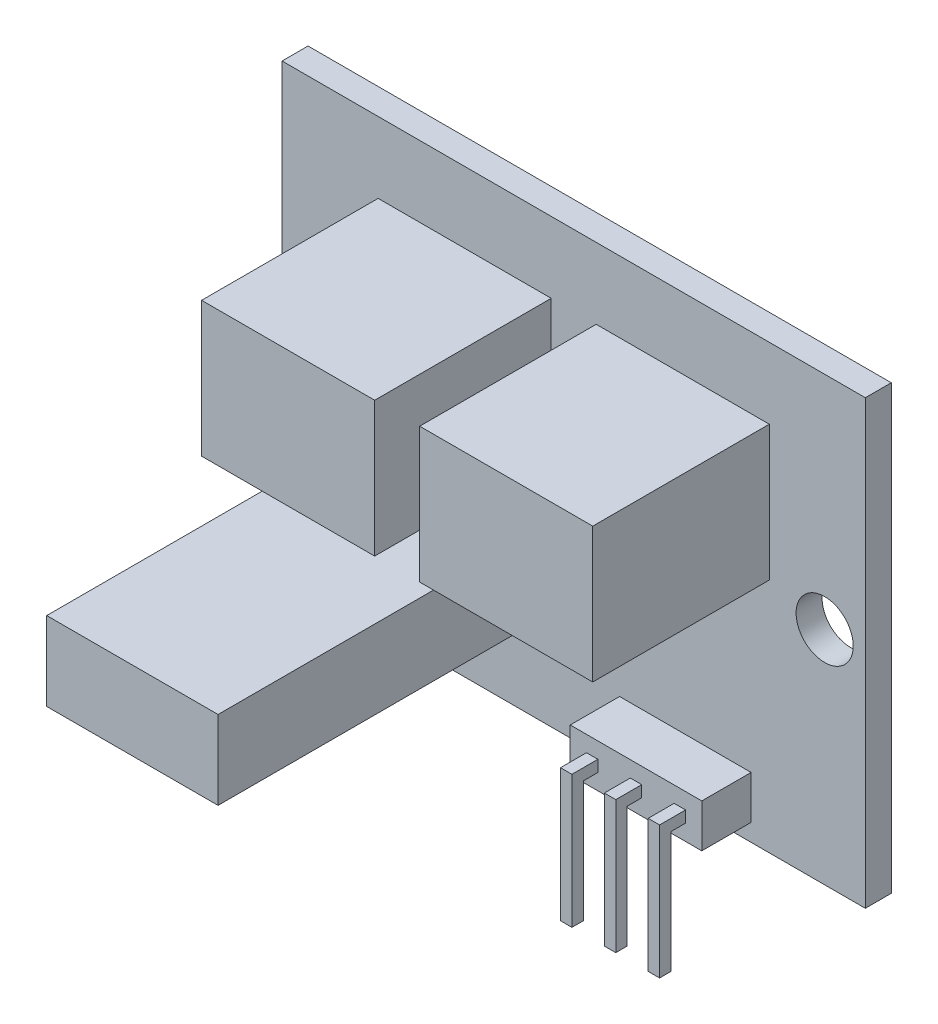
ISO-10303-21;
HEADER;
FILE_DESCRIPTION(('STEP AP214'),'2;1');
FILE_NAME('part.step','',(''),(''),'','','');
FILE_SCHEMA(('AUTOMOTIVE_DESIGN { 1 0 10303 214 1 1 1 1 }'));
ENDSEC;
DATA;
#1=APPLICATION_CONTEXT('core data for automotive mechanical design processes');
#2=APPLICATION_PROTOCOL_DEFINITION('international standard','automotive_design',2000,#1);
#3=PRODUCT_CONTEXT('',#1,'mechanical');
#4=PRODUCT('Part','Part','',(#3));
#5=PRODUCT_RELATED_PRODUCT_CATEGORY('part','',(#4));
#6=PRODUCT_DEFINITION_FORMATION('','',#4);
#7=PRODUCT_DEFINITION_CONTEXT('part definition',#1,'design');
#8=PRODUCT_DEFINITION('design','',#6,#7);
#9=PRODUCT_DEFINITION_SHAPE('','',#8);
#10=(LENGTH_UNIT() NAMED_UNIT(*) SI_UNIT(.MILLI.,.METRE.));
#11=(NAMED_UNIT(*) PLANE_ANGLE_UNIT() SI_UNIT($,.RADIAN.));
#12=(NAMED_UNIT(*) SI_UNIT($,.STERADIAN.) SOLID_ANGLE_UNIT());
#13=UNCERTAINTY_MEASURE_WITH_UNIT(LENGTH_MEASURE(1.E-05),#10,'distance_accuracy_value','');
#14=(GEOMETRIC_REPRESENTATION_CONTEXT(3) GLOBAL_UNCERTAINTY_ASSIGNED_CONTEXT((#13)) GLOBAL_UNIT_ASSIGNED_CONTEXT((#10,
#11,#12)) REPRESENTATION_CONTEXT('',''));
#15=CARTESIAN_POINT('',(0.,0.,0.));
#16=DIRECTION('',(0.,0.,1.));
#17=DIRECTION('',(1.,0.,0.));
#18=AXIS2_PLACEMENT_3D('',#15,#16,#17);
#19=CARTESIAN_POINT('',(25.5033333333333,1.92,5.85));
#20=DIRECTION('',(0.,1.,0.));
#21=DIRECTION('',(0.,0.,1.));
#22=AXIS2_PLACEMENT_3D('',#19,#20,#21);
#23=PLANE('',#22);
#24=DIRECTION('',(1.,0.,0.));
#25=VECTOR('',#24,1.);
#26=CARTESIAN_POINT('',(25.5033333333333,1.92,5.19));
#27=LINE('',#26,#25);
#28=CARTESIAN_POINT('',(25.5033333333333,1.92,5.19));
#29=VERTEX_POINT('',#28);
#30=CARTESIAN_POINT('',(26.1633333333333,1.92,5.19));
#31=VERTEX_POINT('',#30);
#32=EDGE_CURVE('E388',#29,#31,#27,.T.);
#33=ORIENTED_EDGE('',*,*,#32,.F.);
#34=DIRECTION('',(0.,0.,-1.));
#35=VECTOR('',#34,1.);
#36=CARTESIAN_POINT('',(25.5033333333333,1.92,5.85));
#37=LINE('',#36,#35);
#38=CARTESIAN_POINT('',(25.5033333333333,1.92,4.35));
#39=VERTEX_POINT('',#38);
#40=EDGE_CURVE('E393',#29,#39,#37,.T.);
#41=ORIENTED_EDGE('',*,*,#40,.T.);
#42=DIRECTION('',(1.,0.,0.));
#43=VECTOR('',#42,1.);
#44=CARTESIAN_POINT('',(25.5033333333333,1.92,4.35));
#45=LINE('',#44,#43);
#46=CARTESIAN_POINT('',(26.1633333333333,1.92,4.35));
#47=VERTEX_POINT('',#46);
#48=EDGE_CURVE('E465',#39,#47,#45,.T.);
#49=ORIENTED_EDGE('',*,*,#48,.T.);
#50=DIRECTION('',(0.,0.,-1.));
#51=VECTOR('',#50,1.);
#52=CARTESIAN_POINT('',(26.1633333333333,1.92,5.85));
#53=LINE('',#52,#51);
#54=EDGE_CURVE('E478',#31,#47,#53,.T.);
#55=ORIENTED_EDGE('',*,*,#54,.F.);
#56=EDGE_LOOP('',(#33,#41,#49,#55));
#57=FACE_BOUND('',#56,.T.);
#58=ADVANCED_FACE('F42',(#57),#23,.F.);
#59=CARTESIAN_POINT('',(23.63,1.92,5.85));
#60=DIRECTION('',(0.,1.,0.));
#61=DIRECTION('',(0.,0.,1.));
#62=AXIS2_PLACEMENT_3D('',#59,#60,#61);
#63=PLANE('',#62);
#64=DIRECTION('',(1.,0.,0.));
#65=VECTOR('',#64,1.);
#66=CARTESIAN_POINT('',(22.97,1.92,5.19));
#67=LINE('',#66,#65);
#68=CARTESIAN_POINT('',(22.97,1.92,5.19));
#69=VERTEX_POINT('',#68);
#70=CARTESIAN_POINT('',(23.63,1.92,5.19));
#71=VERTEX_POINT('',#70);
#72=EDGE_CURVE('E395',#69,#71,#67,.T.);
#73=ORIENTED_EDGE('',*,*,#72,.F.);
#74=DIRECTION('',(0.,0.,-1.));
#75=VECTOR('',#74,1.);
#76=CARTESIAN_POINT('',(22.97,1.92,5.85));
#77=LINE('',#76,#75);
#78=CARTESIAN_POINT('',(22.97,1.92,4.35));
#79=VERTEX_POINT('',#78);
#80=EDGE_CURVE('E513',#69,#79,#77,.T.);
#81=ORIENTED_EDGE('',*,*,#80,.T.);
#82=DIRECTION('',(1.,0.,0.));
#83=VECTOR('',#82,1.);
#84=CARTESIAN_POINT('',(23.63,1.92,4.35));
#85=LINE('',#84,#83);
#86=CARTESIAN_POINT('',(23.63,1.92,4.35));
#87=VERTEX_POINT('',#86);
#88=EDGE_CURVE('E503',#79,#87,#85,.T.);
#89=ORIENTED_EDGE('',*,*,#88,.T.);
#90=DIRECTION('',(0.,0.,-1.));
#91=VECTOR('',#90,1.);
#92=CARTESIAN_POINT('',(23.63,1.92,5.85));
#93=LINE('',#92,#91);
#94=EDGE_CURVE('E72',#71,#87,#93,.T.);
#95=ORIENTED_EDGE('',*,*,#94,.F.);
#96=EDGE_LOOP('',(#73,#81,#89,#95));
#97=FACE_BOUND('',#96,.T.);
#98=ADVANCED_FACE('F816',(#97),#63,.F.);
#99=CARTESIAN_POINT('',(20.4366666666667,1.92,5.85));
#100=DIRECTION('',(0.,1.,0.));
#101=DIRECTION('',(0.,0.,1.));
#102=AXIS2_PLACEMENT_3D('',#99,#100,#101);
#103=PLANE('',#102);
#104=DIRECTION('',(1.,0.,0.));
#105=VECTOR('',#104,1.);
#106=CARTESIAN_POINT('',(20.4366666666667,1.92,5.19));
#107=LINE('',#106,#105);
#108=CARTESIAN_POINT('',(20.4366666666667,1.92,5.19));
#109=VERTEX_POINT('',#108);
#110=CARTESIAN_POINT('',(21.0966666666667,1.92,5.19));
#111=VERTEX_POINT('',#110);
#112=EDGE_CURVE('E426',#109,#111,#107,.T.);
#113=ORIENTED_EDGE('',*,*,#112,.F.);
#114=DIRECTION('',(0.,0.,-1.));
#115=VECTOR('',#114,1.);
#116=CARTESIAN_POINT('',(20.4366666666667,1.92,5.85));
#117=LINE('',#116,#115);
#118=CARTESIAN_POINT('',(20.4366666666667,1.92,4.35));
#119=VERTEX_POINT('',#118);
#120=EDGE_CURVE('E553',#109,#119,#117,.T.);
#121=ORIENTED_EDGE('',*,*,#120,.T.);
#122=DIRECTION('',(1.,0.,0.));
#123=VECTOR('',#122,1.);
#124=CARTESIAN_POINT('',(20.4366666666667,1.92,4.35));
#125=LINE('',#124,#123);
#126=CARTESIAN_POINT('',(21.0966666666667,1.92,4.35));
#127=VERTEX_POINT('',#126);
#128=EDGE_CURVE('E534',#119,#127,#125,.T.);
#129=ORIENTED_EDGE('',*,*,#128,.T.);
#130=DIRECTION('',(0.,0.,-1.));
#131=VECTOR('',#130,1.);
#132=CARTESIAN_POINT('',(21.0966666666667,1.92,5.85));
#133=LINE('',#132,#131);
#134=EDGE_CURVE('E550',#111,#127,#133,.T.);
#135=ORIENTED_EDGE('',*,*,#134,.F.);
#136=EDGE_LOOP('',(#113,#121,#129,#135));
#137=FACE_BOUND('',#136,.T.);
#138=ADVANCED_FACE('F822',(#137),#103,.F.);
#139=CARTESIAN_POINT('',(0.,0.,4.35));
#140=DIRECTION('',(0.,0.,1.));
#141=DIRECTION('',(1.,0.,0.));
#142=AXIS2_PLACEMENT_3D('',#139,#140,#141);
#143=PLANE('',#142);
#144=DIRECTION('',(0.,-1.,0.));
#145=VECTOR('',#144,1.);
#146=CARTESIAN_POINT('',(19.5,3.5,4.35));
#147=LINE('',#146,#145);
#148=CARTESIAN_POINT('',(19.5,3.5,4.35));
#149=VERTEX_POINT('',#148);
#150=CARTESIAN_POINT('',(19.5,1.,4.35));
#151=VERTEX_POINT('',#150);
#152=EDGE_CURVE('E557',#149,#151,#147,.T.);
#153=ORIENTED_EDGE('',*,*,#152,.T.);
#154=DIRECTION('',(1.,0.,0.));
#155=VECTOR('',#154,1.);
#156=CARTESIAN_POINT('',(19.5,1.,4.35));
#157=LINE('',#156,#155);
#158=CARTESIAN_POINT('',(27.1,1.,4.35));
#159=VERTEX_POINT('',#158);
#160=EDGE_CURVE('E561',#151,#159,#157,.T.);
#161=ORIENTED_EDGE('',*,*,#160,.T.);
#162=DIRECTION('',(0.,1.,0.));
#163=VECTOR('',#162,1.);
#164=CARTESIAN_POINT('',(27.1,3.5,4.35));
#165=LINE('',#164,#163);
#166=CARTESIAN_POINT('',(27.1,3.5,4.35));
#167=VERTEX_POINT('',#166);
#168=EDGE_CURVE('E565',#159,#167,#165,.T.);
#169=ORIENTED_EDGE('',*,*,#168,.T.);
#170=DIRECTION('',(-1.,0.,0.));
#171=VECTOR('',#170,1.);
#172=CARTESIAN_POINT('',(19.5,3.5,4.35));
#173=LINE('',#172,#171);
#174=EDGE_CURVE('E568',#167,#149,#173,.T.);
#175=ORIENTED_EDGE('',*,*,#174,.T.);
#176=EDGE_LOOP('',(#153,#161,#169,#175));
#177=FACE_BOUND('',#176,.T.);
#178=ORIENTED_EDGE('',*,*,#128,.F.);
#179=DIRECTION('',(0.,-1.,0.));
#180=VECTOR('',#179,1.);
#181=CARTESIAN_POINT('',(20.4366666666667,2.58,4.35));
#182=LINE('',#181,#180);
#183=CARTESIAN_POINT('',(20.4366666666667,2.58,4.35));
#184=VERTEX_POINT('',#183);
#185=EDGE_CURVE('E519',#184,#119,#182,.T.);
#186=ORIENTED_EDGE('',*,*,#185,.F.);
#187=DIRECTION('',(-1.,0.,0.));
#188=VECTOR('',#187,1.);
#189=CARTESIAN_POINT('',(20.4366666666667,2.58,4.35));
#190=LINE('',#189,#188);
#191=CARTESIAN_POINT('',(21.0966666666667,2.58,4.35));
#192=VERTEX_POINT('',#191);
#193=EDGE_CURVE('E524',#192,#184,#190,.T.);
#194=ORIENTED_EDGE('',*,*,#193,.F.);
#195=DIRECTION('',(0.,1.,0.));
#196=VECTOR('',#195,1.);
#197=CARTESIAN_POINT('',(21.0966666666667,2.58,4.35));
#198=LINE('',#197,#196);
#199=EDGE_CURVE('E538',#127,#192,#198,.T.);
#200=ORIENTED_EDGE('',*,*,#199,.F.);
#201=EDGE_LOOP('',(#178,#186,#194,#200));
#202=FACE_BOUND('',#201,.T.);
#203=DIRECTION('',(0.,-1.,0.));
#204=VECTOR('',#203,1.);
#205=CARTESIAN_POINT('',(22.97,2.58,4.35));
#206=LINE('',#205,#204);
#207=CARTESIAN_POINT('',(22.97,2.58,4.35));
#208=VERTEX_POINT('',#207);
#209=EDGE_CURVE('E499',#208,#79,#206,.T.);
#210=ORIENTED_EDGE('',*,*,#209,.F.);
#211=DIRECTION('',(-1.,0.,0.));
#212=VECTOR('',#211,1.);
#213=CARTESIAN_POINT('',(23.63,2.58,4.35));
#214=LINE('',#213,#212);
#215=CARTESIAN_POINT('',(23.63,2.58,4.35));
#216=VERTEX_POINT('',#215);
#217=EDGE_CURVE('E483',#216,#208,#214,.T.);
#218=ORIENTED_EDGE('',*,*,#217,.F.);
#219=DIRECTION('',(0.,1.,0.));
#220=VECTOR('',#219,1.);
#221=CARTESIAN_POINT('',(23.63,2.58,4.35));
#222=LINE('',#221,#220);
#223=EDGE_CURVE('E489',#87,#216,#222,.T.);
#224=ORIENTED_EDGE('',*,*,#223,.F.);
#225=ORIENTED_EDGE('',*,*,#88,.F.);
#226=EDGE_LOOP('',(#210,#218,#224,#225));
#227=FACE_BOUND('',#226,.T.);
#228=ORIENTED_EDGE('',*,*,#48,.F.);
#229=DIRECTION('',(0.,-1.,0.));
#230=VECTOR('',#229,1.);
#231=CARTESIAN_POINT('',(25.5033333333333,2.58,4.35));
#232=LINE('',#231,#230);
#233=CARTESIAN_POINT('',(25.5033333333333,2.58,4.35));
#234=VERTEX_POINT('',#233);
#235=EDGE_CURVE('E451',#234,#39,#232,.T.);
#236=ORIENTED_EDGE('',*,*,#235,.F.);
#237=DIRECTION('',(-1.,0.,0.));
#238=VECTOR('',#237,1.);
#239=CARTESIAN_POINT('',(25.5033333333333,2.58,4.35));
#240=LINE('',#239,#238);
#241=CARTESIAN_POINT('',(26.1633333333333,2.58,4.35));
#242=VERTEX_POINT('',#241);
#243=EDGE_CURVE('E456',#242,#234,#240,.T.);
#244=ORIENTED_EDGE('',*,*,#243,.F.);
#245=DIRECTION('',(0.,1.,0.));
#246=VECTOR('',#245,1.);
#247=CARTESIAN_POINT('',(26.1633333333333,2.58,4.35));
#248=LINE('',#247,#246);
#249=EDGE_CURVE('E469',#47,#242,#248,.T.);
#250=ORIENTED_EDGE('',*,*,#249,.F.);
#251=EDGE_LOOP('',(#228,#236,#244,#250));
#252=FACE_BOUND('',#251,.T.);
#253=ADVANCED_FACE('F861',(#177,#202,#227,#252),#143,.T.);
#254=CARTESIAN_POINT('',(0.,0.,1.5));
#255=DIRECTION('',(0.,0.,-1.));
#256=DIRECTION('',(-1.,0.,0.));
#257=AXIS2_PLACEMENT_3D('',#254,#255,#256);
#258=PLANE('',#257);
#259=DIRECTION('',(0.,-1.,0.));
#260=VECTOR('',#259,1.);
#261=CARTESIAN_POINT('',(5.4,10.,1.5));
#262=LINE('',#261,#260);
#263=CARTESIAN_POINT('',(5.4,10.,1.5));
#264=VERTEX_POINT('',#263);
#265=CARTESIAN_POINT('',(5.4,5.45,1.5));
#266=VERTEX_POINT('',#265);
#267=EDGE_CURVE('E600',#264,#266,#262,.T.);
#268=ORIENTED_EDGE('',*,*,#267,.F.);
#269=DIRECTION('',(-1.,0.,0.));
#270=VECTOR('',#269,1.);
#271=CARTESIAN_POINT('',(5.4,10.,1.5));
#272=LINE('',#271,#270);
#273=CARTESIAN_POINT('',(15.3,10.,1.5));
#274=VERTEX_POINT('',#273);
#275=EDGE_CURVE('E606',#274,#264,#272,.T.);
#276=ORIENTED_EDGE('',*,*,#275,.F.);
#277=DIRECTION('',(0.,1.,0.));
#278=VECTOR('',#277,1.);
#279=CARTESIAN_POINT('',(15.3,10.,1.5));
#280=LINE('',#279,#278);
#281=CARTESIAN_POINT('',(15.3,5.45,1.5));
#282=VERTEX_POINT('',#281);
#283=EDGE_CURVE('E623',#282,#274,#280,.T.);
#284=ORIENTED_EDGE('',*,*,#283,.F.);
#285=DIRECTION('',(1.,0.,0.));
#286=VECTOR('',#285,1.);
#287=CARTESIAN_POINT('',(5.4,5.45,1.5));
#288=LINE('',#287,#286);
#289=EDGE_CURVE('E619',#266,#282,#288,.T.);
#290=ORIENTED_EDGE('',*,*,#289,.F.);
#291=EDGE_LOOP('',(#268,#276,#284,#290));
#292=FACE_BOUND('',#291,.T.);
#293=DIRECTION('',(0.,-1.,0.));
#294=VECTOR('',#293,1.);
#295=CARTESIAN_POINT('',(5.55,21.45,1.5));
#296=LINE('',#295,#294);
#297=CARTESIAN_POINT('',(5.55,21.45,1.5));
#298=VERTEX_POINT('',#297);
#299=CARTESIAN_POINT('',(5.55,13.65,1.5));
#300=VERTEX_POINT('',#299);
#301=EDGE_CURVE('E690',#298,#300,#296,.T.);
#302=ORIENTED_EDGE('',*,*,#301,.F.);
#303=DIRECTION('',(-1.,0.,0.));
#304=VECTOR('',#303,1.);
#305=CARTESIAN_POINT('',(5.55,21.45,1.5));
#306=LINE('',#305,#304);
#307=CARTESIAN_POINT('',(15.55,21.45,1.5));
#308=VERTEX_POINT('',#307);
#309=EDGE_CURVE('E696',#308,#298,#306,.T.);
#310=ORIENTED_EDGE('',*,*,#309,.F.);
#311=DIRECTION('',(0.,1.,0.));
#312=VECTOR('',#311,1.);
#313=CARTESIAN_POINT('',(15.55,21.45,1.5));
#314=LINE('',#313,#312);
#315=CARTESIAN_POINT('',(15.55,13.65,1.5));
#316=VERTEX_POINT('',#315);
#317=EDGE_CURVE('E713',#316,#308,#314,.T.);
#318=ORIENTED_EDGE('',*,*,#317,.F.);
#319=DIRECTION('',(1.,0.,0.));
#320=VECTOR('',#319,1.);
#321=CARTESIAN_POINT('',(5.55,13.65,1.5));
#322=LINE('',#321,#320);
#323=EDGE_CURVE('E709',#300,#316,#322,.T.);
#324=ORIENTED_EDGE('',*,*,#323,.F.);
#325=EDGE_LOOP('',(#302,#310,#318,#324));
#326=FACE_BOUND('',#325,.T.);
#327=DIRECTION('',(0.,-1.,0.));
#328=VECTOR('',#327,1.);
#329=CARTESIAN_POINT('',(0.,0.,1.5));
#330=LINE('',#329,#328);
#331=CARTESIAN_POINT('',(0.,25.55,1.5));
#332=VERTEX_POINT('',#331);
#333=CARTESIAN_POINT('',(0.,0.,1.5));
#334=VERTEX_POINT('',#333);
#335=EDGE_CURVE('E752',#332,#334,#330,.T.);
#336=ORIENTED_EDGE('',*,*,#335,.T.);
#337=DIRECTION('',(1.,0.,0.));
#338=VECTOR('',#337,1.);
#339=CARTESIAN_POINT('',(0.,0.,1.5));
#340=LINE('',#339,#338);
#341=CARTESIAN_POINT('',(33.7,0.,1.5));
#342=VERTEX_POINT('',#341);
#343=EDGE_CURVE('E756',#334,#342,#340,.T.);
#344=ORIENTED_EDGE('',*,*,#343,.T.);
#345=DIRECTION('',(0.,1.,0.));
#346=VECTOR('',#345,1.);
#347=CARTESIAN_POINT('',(33.7,0.,1.5));
#348=LINE('',#347,#346);
#349=CARTESIAN_POINT('',(33.7,25.55,1.5));
#350=VERTEX_POINT('',#349);
#351=EDGE_CURVE('E760',#342,#350,#348,.T.);
#352=ORIENTED_EDGE('',*,*,#351,.T.);
#353=DIRECTION('',(-1.,0.,0.));
#354=VECTOR('',#353,1.);
#355=CARTESIAN_POINT('',(0.,25.55,1.5));
#356=LINE('',#355,#354);
#357=EDGE_CURVE('E763',#350,#332,#356,.T.);
#358=ORIENTED_EDGE('',*,*,#357,.T.);
#359=EDGE_LOOP('',(#336,#344,#352,#358));
#360=FACE_BOUND('',#359,.T.);
#361=CARTESIAN_POINT('',(31.35,12.775,1.5));
#362=DIRECTION('',(0.,0.,1.));
#363=DIRECTION('',(1.,0.,0.));
#364=AXIS2_PLACEMENT_3D('',#361,#362,#363);
#365=CIRCLE('',#364,1.65);
#366=CARTESIAN_POINT('',(33.,12.775,1.5));
#367=VERTEX_POINT('',#366);
#368=EDGE_CURVE('E744',#367,#367,#365,.T.);
#369=ORIENTED_EDGE('',*,*,#368,.F.);
#370=EDGE_LOOP('',(#369));
#371=FACE_BOUND('',#370,.T.);
#372=CARTESIAN_POINT('',(2.35,12.775,1.5));
#373=DIRECTION('',(0.,0.,1.));
#374=DIRECTION('',(1.,0.,0.));
#375=AXIS2_PLACEMENT_3D('',#372,#373,#374);
#376=CIRCLE('',#375,1.65);
#377=CARTESIAN_POINT('',(4.,12.775,1.5));
#378=VERTEX_POINT('',#377);
#379=EDGE_CURVE('E736',#378,#378,#376,.T.);
#380=ORIENTED_EDGE('',*,*,#379,.F.);
#381=EDGE_LOOP('',(#380));
#382=FACE_BOUND('',#381,.T.);
#383=DIRECTION('',(-1.,0.,0.));
#384=VECTOR('',#383,1.);
#385=CARTESIAN_POINT('',(28.15,21.45,1.5));
#386=LINE('',#385,#384);
#387=CARTESIAN_POINT('',(28.15,21.45,1.5));
#388=VERTEX_POINT('',#387);
#389=CARTESIAN_POINT('',(18.15,21.45,1.5));
#390=VERTEX_POINT('',#389);
#391=EDGE_CURVE('E645',#388,#390,#386,.T.);
#392=ORIENTED_EDGE('',*,*,#391,.F.);
#393=DIRECTION('',(0.,1.,0.));
#394=VECTOR('',#393,1.);
#395=CARTESIAN_POINT('',(28.15,21.45,1.5));
#396=LINE('',#395,#394);
#397=CARTESIAN_POINT('',(28.15,13.65,1.5));
#398=VERTEX_POINT('',#397);
#399=EDGE_CURVE('E651',#398,#388,#396,.T.);
#400=ORIENTED_EDGE('',*,*,#399,.F.);
#401=DIRECTION('',(1.,0.,0.));
#402=VECTOR('',#401,1.);
#403=CARTESIAN_POINT('',(28.15,13.65,1.5));
#404=LINE('',#403,#402);
#405=CARTESIAN_POINT('',(18.15,13.65,1.5));
#406=VERTEX_POINT('',#405);
#407=EDGE_CURVE('E668',#406,#398,#404,.T.);
#408=ORIENTED_EDGE('',*,*,#407,.F.);
#409=DIRECTION('',(0.,-1.,0.));
#410=VECTOR('',#409,1.);
#411=CARTESIAN_POINT('',(18.15,21.45,1.5));
#412=LINE('',#411,#410);
#413=EDGE_CURVE('E664',#390,#406,#412,.T.);
#414=ORIENTED_EDGE('',*,*,#413,.F.);
#415=EDGE_LOOP('',(#392,#400,#408,#414));
#416=FACE_BOUND('',#415,.T.);
#417=DIRECTION('',(0.,-1.,0.));
#418=VECTOR('',#417,1.);
#419=CARTESIAN_POINT('',(19.5,3.5,1.5));
#420=LINE('',#419,#418);
#421=CARTESIAN_POINT('',(19.5,3.5,1.5));
#422=VERTEX_POINT('',#421);
#423=CARTESIAN_POINT('',(19.5,1.,1.5));
#424=VERTEX_POINT('',#423);
#425=EDGE_CURVE('E556',#422,#424,#420,.T.);
#426=ORIENTED_EDGE('',*,*,#425,.F.);
#427=DIRECTION('',(-1.,0.,0.));
#428=VECTOR('',#427,1.);
#429=CARTESIAN_POINT('',(19.5,3.5,1.5));
#430=LINE('',#429,#428);
#431=CARTESIAN_POINT('',(27.1,3.5,1.5));
#432=VERTEX_POINT('',#431);
#433=EDGE_CURVE('E562',#432,#422,#430,.T.);
#434=ORIENTED_EDGE('',*,*,#433,.F.);
#435=DIRECTION('',(0.,1.,0.));
#436=VECTOR('',#435,1.);
#437=CARTESIAN_POINT('',(27.1,3.5,1.5));
#438=LINE('',#437,#436);
#439=CARTESIAN_POINT('',(27.1,1.,1.5));
#440=VERTEX_POINT('',#439);
#441=EDGE_CURVE('E578',#440,#432,#438,.T.);
#442=ORIENTED_EDGE('',*,*,#441,.F.);
#443=DIRECTION('',(1.,0.,0.));
#444=VECTOR('',#443,1.);
#445=CARTESIAN_POINT('',(19.5,1.,1.5));
#446=LINE('',#445,#444);
#447=EDGE_CURVE('E574',#424,#440,#446,.T.);
#448=ORIENTED_EDGE('',*,*,#447,.F.);
#449=EDGE_LOOP('',(#426,#434,#442,#448));
#450=FACE_BOUND('',#449,.T.);
#451=ADVANCED_FACE('F806',(#292,#326,#360,#371,#382,#416,#450),#258,.F.);
#452=CARTESIAN_POINT('',(0.,0.,0.));
#453=DIRECTION('',(0.,0.,-1.));
#454=DIRECTION('',(-1.,0.,0.));
#455=AXIS2_PLACEMENT_3D('',#452,#453,#454);
#456=PLANE('',#455);
#457=CARTESIAN_POINT('',(31.35,12.775,0.));
#458=DIRECTION('',(0.,0.,1.));
#459=DIRECTION('',(1.,0.,0.));
#460=AXIS2_PLACEMENT_3D('',#457,#458,#459);
#461=CIRCLE('',#460,1.65);
#462=CARTESIAN_POINT('',(33.,12.775,0.));
#463=VERTEX_POINT('',#462);
#464=EDGE_CURVE('E740',#463,#463,#461,.T.);
#465=ORIENTED_EDGE('',*,*,#464,.T.);
#466=EDGE_LOOP('',(#465));
#467=FACE_BOUND('',#466,.T.);
#468=DIRECTION('',(0.,-1.,0.));
#469=VECTOR('',#468,1.);
#470=CARTESIAN_POINT('',(0.,0.,0.));
#471=LINE('',#470,#469);
#472=CARTESIAN_POINT('',(0.,25.55,0.));
#473=VERTEX_POINT('',#472);
#474=CARTESIAN_POINT('',(0.,0.,0.));
#475=VERTEX_POINT('',#474);
#476=EDGE_CURVE('E748',#473,#475,#471,.T.);
#477=ORIENTED_EDGE('',*,*,#476,.F.);
#478=DIRECTION('',(-1.,0.,0.));
#479=VECTOR('',#478,1.);
#480=CARTESIAN_POINT('',(0.,25.55,0.));
#481=LINE('',#480,#479);
#482=CARTESIAN_POINT('',(33.7,25.55,0.));
#483=VERTEX_POINT('',#482);
#484=EDGE_CURVE('E757',#483,#473,#481,.T.);
#485=ORIENTED_EDGE('',*,*,#484,.F.);
#486=DIRECTION('',(0.,1.,0.));
#487=VECTOR('',#486,1.);
#488=CARTESIAN_POINT('',(33.7,0.,0.));
#489=LINE('',#488,#487);
#490=CARTESIAN_POINT('',(33.7,0.,0.));
#491=VERTEX_POINT('',#490);
#492=EDGE_CURVE('E773',#491,#483,#489,.T.);
#493=ORIENTED_EDGE('',*,*,#492,.F.);
#494=DIRECTION('',(1.,0.,0.));
#495=VECTOR('',#494,1.);
#496=CARTESIAN_POINT('',(0.,0.,0.));
#497=LINE('',#496,#495);
#498=EDGE_CURVE('E770',#475,#491,#497,.T.);
#499=ORIENTED_EDGE('',*,*,#498,.F.);
#500=EDGE_LOOP('',(#477,#485,#493,#499));
#501=FACE_BOUND('',#500,.T.);
#502=CARTESIAN_POINT('',(2.35,12.775,0.));
#503=DIRECTION('',(0.,0.,1.));
#504=DIRECTION('',(1.,0.,0.));
#505=AXIS2_PLACEMENT_3D('',#502,#503,#504);
#506=CIRCLE('',#505,1.65);
#507=CARTESIAN_POINT('',(4.,12.775,0.));
#508=VERTEX_POINT('',#507);
#509=EDGE_CURVE('E735',#508,#508,#506,.T.);
#510=ORIENTED_EDGE('',*,*,#509,.T.);
#511=EDGE_LOOP('',(#510));
#512=FACE_BOUND('',#511,.T.);
#513=ADVANCED_FACE('F796',(#467,#501,#512),#456,.T.);
#514=CARTESIAN_POINT('',(0.,0.,1.5));
#515=DIRECTION('',(1.,0.,0.));
#516=DIRECTION('',(0.,0.,-1.));
#517=AXIS2_PLACEMENT_3D('',#514,#515,#516);
#518=PLANE('',#517);
#519=ORIENTED_EDGE('',*,*,#476,.T.);
#520=DIRECTION('',(0.,0.,-1.));
#521=VECTOR('',#520,1.);
#522=CARTESIAN_POINT('',(0.,0.,1.5));
#523=LINE('',#522,#521);
#524=EDGE_CURVE('E11',#334,#475,#523,.T.);
#525=ORIENTED_EDGE('',*,*,#524,.F.);
#526=ORIENTED_EDGE('',*,*,#335,.F.);
#527=DIRECTION('',(0.,0.,-1.));
#528=VECTOR('',#527,1.);
#529=CARTESIAN_POINT('',(0.,25.55,1.5));
#530=LINE('',#529,#528);
#531=EDGE_CURVE('E766',#332,#473,#530,.T.);
#532=ORIENTED_EDGE('',*,*,#531,.T.);
#533=EDGE_LOOP('',(#519,#525,#526,#532));
#534=FACE_BOUND('',#533,.T.);
#535=ADVANCED_FACE('F44',(#534),#518,.F.);
#536=CARTESIAN_POINT('',(0.,0.,1.5));
#537=DIRECTION('',(0.,1.,0.));
#538=DIRECTION('',(0.,0.,1.));
#539=AXIS2_PLACEMENT_3D('',#536,#537,#538);
#540=PLANE('',#539);
#541=ORIENTED_EDGE('',*,*,#498,.T.);
#542=DIRECTION('',(0.,0.,-1.));
#543=VECTOR('',#542,1.);
#544=CARTESIAN_POINT('',(33.7,0.,1.5));
#545=LINE('',#544,#543);
#546=EDGE_CURVE('E51',#342,#491,#545,.T.);
#547=ORIENTED_EDGE('',*,*,#546,.F.);
#548=ORIENTED_EDGE('',*,*,#343,.F.);
#549=ORIENTED_EDGE('',*,*,#524,.T.);
#550=EDGE_LOOP('',(#541,#547,#548,#549));
#551=FACE_BOUND('',#550,.T.);
#552=ADVANCED_FACE('F808',(#551),#540,.F.);
#553=CARTESIAN_POINT('',(33.7,0.,1.5));
#554=DIRECTION('',(-1.,0.,0.));
#555=DIRECTION('',(0.,0.,1.));
#556=AXIS2_PLACEMENT_3D('',#553,#554,#555);
#557=PLANE('',#556);
#558=ORIENTED_EDGE('',*,*,#492,.T.);
#559=DIRECTION('',(0.,0.,-1.));
#560=VECTOR('',#559,1.);
#561=CARTESIAN_POINT('',(33.7,25.55,1.5));
#562=LINE('',#561,#560);
#563=EDGE_CURVE('E781',#350,#483,#562,.T.);
#564=ORIENTED_EDGE('',*,*,#563,.F.);
#565=ORIENTED_EDGE('',*,*,#351,.F.);
#566=ORIENTED_EDGE('',*,*,#546,.T.);
#567=EDGE_LOOP('',(#558,#564,#565,#566));
#568=FACE_BOUND('',#567,.T.);
#569=ADVANCED_FACE('F790',(#568),#557,.F.);
#570=CARTESIAN_POINT('',(0.,25.55,1.5));
#571=DIRECTION('',(0.,-1.,0.));
#572=DIRECTION('',(0.,0.,-1.));
#573=AXIS2_PLACEMENT_3D('',#570,#571,#572);
#574=PLANE('',#573);
#575=ORIENTED_EDGE('',*,*,#484,.T.);
#576=ORIENTED_EDGE('',*,*,#531,.F.);
#577=ORIENTED_EDGE('',*,*,#357,.F.);
#578=ORIENTED_EDGE('',*,*,#563,.T.);
#579=EDGE_LOOP('',(#575,#576,#577,#578));
#580=FACE_BOUND('',#579,.T.);
#581=ADVANCED_FACE('F800',(#580),#574,.F.);
#582=CARTESIAN_POINT('',(31.35,12.775,1.5));
#583=DIRECTION('',(0.,0.,-1.));
#584=DIRECTION('',(-1.,0.,0.));
#585=AXIS2_PLACEMENT_3D('',#582,#583,#584);
#586=CYLINDRICAL_SURFACE('',#585,1.65);
#587=ORIENTED_EDGE('',*,*,#368,.T.);
#588=EDGE_LOOP('',(#587));
#589=FACE_BOUND('',#588,.T.);
#590=ORIENTED_EDGE('',*,*,#464,.F.);
#591=EDGE_LOOP('',(#590));
#592=FACE_BOUND('',#591,.T.);
#593=ADVANCED_FACE('F948',(#589,#592),#586,.F.);
#594=CARTESIAN_POINT('',(2.35,12.775,1.5));
#595=DIRECTION('',(0.,0.,-1.));
#596=DIRECTION('',(-1.,0.,0.));
#597=AXIS2_PLACEMENT_3D('',#594,#595,#596);
#598=CYLINDRICAL_SURFACE('',#597,1.65);
#599=ORIENTED_EDGE('',*,*,#379,.T.);
#600=EDGE_LOOP('',(#599));
#601=FACE_BOUND('',#600,.T.);
#602=ORIENTED_EDGE('',*,*,#509,.F.);
#603=EDGE_LOOP('',(#602));
#604=FACE_BOUND('',#603,.T.);
#605=ADVANCED_FACE('F944',(#601,#604),#598,.F.);
#606=CARTESIAN_POINT('',(5.55,21.45,11.7));
#607=DIRECTION('',(1.,0.,0.));
#608=DIRECTION('',(0.,1.,0.));
#609=AXIS2_PLACEMENT_3D('',#606,#607,#608);
#610=PLANE('',#609);
#611=ORIENTED_EDGE('',*,*,#301,.T.);
#612=DIRECTION('',(0.,0.,-1.));
#613=VECTOR('',#612,1.);
#614=CARTESIAN_POINT('',(5.55,13.65,11.7));
#615=LINE('',#614,#613);
#616=CARTESIAN_POINT('',(5.55,13.65,11.7));
#617=VERTEX_POINT('',#616);
#618=EDGE_CURVE('E731',#617,#300,#615,.T.);
#619=ORIENTED_EDGE('',*,*,#618,.F.);
#620=DIRECTION('',(0.,-1.,0.));
#621=VECTOR('',#620,1.);
#622=CARTESIAN_POINT('',(5.55,21.45,11.7));
#623=LINE('',#622,#621);
#624=CARTESIAN_POINT('',(5.55,21.45,11.7));
#625=VERTEX_POINT('',#624);
#626=EDGE_CURVE('E691',#625,#617,#623,.T.);
#627=ORIENTED_EDGE('',*,*,#626,.F.);
#628=DIRECTION('',(0.,0.,-1.));
#629=VECTOR('',#628,1.);
#630=CARTESIAN_POINT('',(5.55,21.45,11.7));
#631=LINE('',#630,#629);
#632=EDGE_CURVE('E705',#625,#298,#631,.T.);
#633=ORIENTED_EDGE('',*,*,#632,.T.);
#634=EDGE_LOOP('',(#611,#619,#627,#633));
#635=FACE_BOUND('',#634,.T.);
#636=ADVANCED_FACE('F940',(#635),#610,.F.);
#637=CARTESIAN_POINT('',(5.55,13.65,11.7));
#638=DIRECTION('',(0.,1.,0.));
#639=DIRECTION('',(-1.,0.,0.));
#640=AXIS2_PLACEMENT_3D('',#637,#638,#639);
#641=PLANE('',#640);
#642=ORIENTED_EDGE('',*,*,#323,.T.);
#643=DIRECTION('',(0.,0.,-1.));
#644=VECTOR('',#643,1.);
#645=CARTESIAN_POINT('',(15.55,13.65,11.7));
#646=LINE('',#645,#644);
#647=CARTESIAN_POINT('',(15.55,13.65,11.7));
#648=VERTEX_POINT('',#647);
#649=EDGE_CURVE('E727',#648,#316,#646,.T.);
#650=ORIENTED_EDGE('',*,*,#649,.F.);
#651=DIRECTION('',(1.,0.,0.));
#652=VECTOR('',#651,1.);
#653=CARTESIAN_POINT('',(5.55,13.65,11.7));
#654=LINE('',#653,#652);
#655=EDGE_CURVE('E695',#617,#648,#654,.T.);
#656=ORIENTED_EDGE('',*,*,#655,.F.);
#657=ORIENTED_EDGE('',*,*,#618,.T.);
#658=EDGE_LOOP('',(#642,#650,#656,#657));
#659=FACE_BOUND('',#658,.T.);
#660=ADVANCED_FACE('F936',(#659),#641,.F.);
#661=CARTESIAN_POINT('',(15.55,21.45,11.7));
#662=DIRECTION('',(-1.,0.,0.));
#663=DIRECTION('',(0.,-1.,0.));
#664=AXIS2_PLACEMENT_3D('',#661,#662,#663);
#665=PLANE('',#664);
#666=ORIENTED_EDGE('',*,*,#317,.T.);
#667=DIRECTION('',(0.,0.,-1.));
#668=VECTOR('',#667,1.);
#669=CARTESIAN_POINT('',(15.55,21.45,11.7));
#670=LINE('',#669,#668);
#671=CARTESIAN_POINT('',(15.55,21.45,11.7));
#672=VERTEX_POINT('',#671);
#673=EDGE_CURVE('E723',#672,#308,#670,.T.);
#674=ORIENTED_EDGE('',*,*,#673,.F.);
#675=DIRECTION('',(0.,1.,0.));
#676=VECTOR('',#675,1.);
#677=CARTESIAN_POINT('',(15.55,21.45,11.7));
#678=LINE('',#677,#676);
#679=EDGE_CURVE('E699',#648,#672,#678,.T.);
#680=ORIENTED_EDGE('',*,*,#679,.F.);
#681=ORIENTED_EDGE('',*,*,#649,.T.);
#682=EDGE_LOOP('',(#666,#674,#680,#681));
#683=FACE_BOUND('',#682,.T.);
#684=ADVANCED_FACE('F932',(#683),#665,.F.);
#685=CARTESIAN_POINT('',(5.55,21.45,11.7));
#686=DIRECTION('',(0.,-1.,0.));
#687=DIRECTION('',(1.,0.,0.));
#688=AXIS2_PLACEMENT_3D('',#685,#686,#687);
#689=PLANE('',#688);
#690=ORIENTED_EDGE('',*,*,#309,.T.);
#691=ORIENTED_EDGE('',*,*,#632,.F.);
#692=DIRECTION('',(-1.,0.,0.));
#693=VECTOR('',#692,1.);
#694=CARTESIAN_POINT('',(5.55,21.45,11.7));
#695=LINE('',#694,#693);
#696=EDGE_CURVE('E702',#672,#625,#695,.T.);
#697=ORIENTED_EDGE('',*,*,#696,.F.);
#698=ORIENTED_EDGE('',*,*,#673,.T.);
#699=EDGE_LOOP('',(#690,#691,#697,#698));
#700=FACE_BOUND('',#699,.T.);
#701=ADVANCED_FACE('F928',(#700),#689,.F.);
#702=CARTESIAN_POINT('',(0.,0.,11.7));
#703=DIRECTION('',(0.,0.,1.));
#704=DIRECTION('',(1.,0.,0.));
#705=AXIS2_PLACEMENT_3D('',#702,#703,#704);
#706=PLANE('',#705);
#707=ORIENTED_EDGE('',*,*,#626,.T.);
#708=ORIENTED_EDGE('',*,*,#655,.T.);
#709=ORIENTED_EDGE('',*,*,#679,.T.);
#710=ORIENTED_EDGE('',*,*,#696,.T.);
#711=EDGE_LOOP('',(#707,#708,#709,#710));
#712=FACE_BOUND('',#711,.T.);
#713=ADVANCED_FACE('F924',(#712),#706,.T.);
#714=CARTESIAN_POINT('',(28.15,21.45,11.7));
#715=DIRECTION('',(0.,-1.,0.));
#716=DIRECTION('',(1.,0.,0.));
#717=AXIS2_PLACEMENT_3D('',#714,#715,#716);
#718=PLANE('',#717);
#719=ORIENTED_EDGE('',*,*,#391,.T.);
#720=DIRECTION('',(0.,0.,-1.));
#721=VECTOR('',#720,1.);
#722=CARTESIAN_POINT('',(18.15,21.45,11.7));
#723=LINE('',#722,#721);
#724=CARTESIAN_POINT('',(18.15,21.45,11.7));
#725=VERTEX_POINT('',#724);
#726=EDGE_CURVE('E686',#725,#390,#723,.T.);
#727=ORIENTED_EDGE('',*,*,#726,.F.);
#728=DIRECTION('',(-1.,0.,0.));
#729=VECTOR('',#728,1.);
#730=CARTESIAN_POINT('',(28.15,21.45,11.7));
#731=LINE('',#730,#729);
#732=CARTESIAN_POINT('',(28.15,21.45,11.7));
#733=VERTEX_POINT('',#732);
#734=EDGE_CURVE('E646',#733,#725,#731,.T.);
#735=ORIENTED_EDGE('',*,*,#734,.F.);
#736=DIRECTION('',(0.,0.,-1.));
#737=VECTOR('',#736,1.);
#738=CARTESIAN_POINT('',(28.15,21.45,11.7));
#739=LINE('',#738,#737);
#740=EDGE_CURVE('E660',#733,#388,#739,.T.);
#741=ORIENTED_EDGE('',*,*,#740,.T.);
#742=EDGE_LOOP('',(#719,#727,#735,#741));
#743=FACE_BOUND('',#742,.T.);
#744=ADVANCED_FACE('F920',(#743),#718,.F.);
#745=CARTESIAN_POINT('',(18.15,21.45,11.7));
#746=DIRECTION('',(1.,0.,0.));
#747=DIRECTION('',(0.,0.,-1.));
#748=AXIS2_PLACEMENT_3D('',#745,#746,#747);
#749=PLANE('',#748);
#750=ORIENTED_EDGE('',*,*,#413,.T.);
#751=DIRECTION('',(0.,0.,-1.));
#752=VECTOR('',#751,1.);
#753=CARTESIAN_POINT('',(18.15,13.65,11.7));
#754=LINE('',#753,#752);
#755=CARTESIAN_POINT('',(18.15,13.65,11.7));
#756=VERTEX_POINT('',#755);
#757=EDGE_CURVE('E682',#756,#406,#754,.T.);
#758=ORIENTED_EDGE('',*,*,#757,.F.);
#759=DIRECTION('',(0.,-1.,0.));
#760=VECTOR('',#759,1.);
#761=CARTESIAN_POINT('',(18.15,21.45,11.7));
#762=LINE('',#761,#760);
#763=EDGE_CURVE('E650',#725,#756,#762,.T.);
#764=ORIENTED_EDGE('',*,*,#763,.F.);
#765=ORIENTED_EDGE('',*,*,#726,.T.);
#766=EDGE_LOOP('',(#750,#758,#764,#765));
#767=FACE_BOUND('',#766,.T.);
#768=ADVANCED_FACE('F916',(#767),#749,.F.);
#769=CARTESIAN_POINT('',(28.15,13.65,11.7));
#770=DIRECTION('',(0.,1.,0.));
#771=DIRECTION('',(-1.,0.,0.));
#772=AXIS2_PLACEMENT_3D('',#769,#770,#771);
#773=PLANE('',#772);
#774=ORIENTED_EDGE('',*,*,#407,.T.);
#775=DIRECTION('',(0.,0.,-1.));
#776=VECTOR('',#775,1.);
#777=CARTESIAN_POINT('',(28.15,13.65,11.7));
#778=LINE('',#777,#776);
#779=CARTESIAN_POINT('',(28.15,13.65,11.7));
#780=VERTEX_POINT('',#779);
#781=EDGE_CURVE('E678',#780,#398,#778,.T.);
#782=ORIENTED_EDGE('',*,*,#781,.F.);
#783=DIRECTION('',(1.,0.,0.));
#784=VECTOR('',#783,1.);
#785=CARTESIAN_POINT('',(28.15,13.65,11.7));
#786=LINE('',#785,#784);
#787=EDGE_CURVE('E654',#756,#780,#786,.T.);
#788=ORIENTED_EDGE('',*,*,#787,.F.);
#789=ORIENTED_EDGE('',*,*,#757,.T.);
#790=EDGE_LOOP('',(#774,#782,#788,#789));
#791=FACE_BOUND('',#790,.T.);
#792=ADVANCED_FACE('F912',(#791),#773,.F.);
#793=CARTESIAN_POINT('',(28.15,21.45,11.7));
#794=DIRECTION('',(-1.,0.,0.));
#795=DIRECTION('',(0.,0.,1.));
#796=AXIS2_PLACEMENT_3D('',#793,#794,#795);
#797=PLANE('',#796);
#798=ORIENTED_EDGE('',*,*,#399,.T.);
#799=ORIENTED_EDGE('',*,*,#740,.F.);
#800=DIRECTION('',(0.,1.,0.));
#801=VECTOR('',#800,1.);
#802=CARTESIAN_POINT('',(28.15,21.45,11.7));
#803=LINE('',#802,#801);
#804=EDGE_CURVE('E657',#780,#733,#803,.T.);
#805=ORIENTED_EDGE('',*,*,#804,.F.);
#806=ORIENTED_EDGE('',*,*,#781,.T.);
#807=EDGE_LOOP('',(#798,#799,#805,#806));
#808=FACE_BOUND('',#807,.T.);
#809=ADVANCED_FACE('F908',(#808),#797,.F.);
#810=CARTESIAN_POINT('',(0.,0.,11.7));
#811=DIRECTION('',(0.,0.,1.));
#812=DIRECTION('',(1.,0.,0.));
#813=AXIS2_PLACEMENT_3D('',#810,#811,#812);
#814=PLANE('',#813);
#815=ORIENTED_EDGE('',*,*,#734,.T.);
#816=ORIENTED_EDGE('',*,*,#763,.T.);
#817=ORIENTED_EDGE('',*,*,#787,.T.);
#818=ORIENTED_EDGE('',*,*,#804,.T.);
#819=EDGE_LOOP('',(#815,#816,#817,#818));
#820=FACE_BOUND('',#819,.T.);
#821=ADVANCED_FACE('F904',(#820),#814,.T.);
#822=CARTESIAN_POINT('',(5.4,10.,20.5));
#823=DIRECTION('',(1.,0.,0.));
#824=DIRECTION('',(0.,1.,0.));
#825=AXIS2_PLACEMENT_3D('',#822,#823,#824);
#826=PLANE('',#825);
#827=ORIENTED_EDGE('',*,*,#267,.T.);
#828=DIRECTION('',(0.,0.,-1.));
#829=VECTOR('',#828,1.);
#830=CARTESIAN_POINT('',(5.4,5.45,20.5));
#831=LINE('',#830,#829);
#832=CARTESIAN_POINT('',(5.4,5.45,20.5));
#833=VERTEX_POINT('',#832);
#834=EDGE_CURVE('E641',#833,#266,#831,.T.);
#835=ORIENTED_EDGE('',*,*,#834,.F.);
#836=DIRECTION('',(0.,-1.,0.));
#837=VECTOR('',#836,1.);
#838=CARTESIAN_POINT('',(5.4,10.,20.5));
#839=LINE('',#838,#837);
#840=CARTESIAN_POINT('',(5.4,10.,20.5));
#841=VERTEX_POINT('',#840);
#842=EDGE_CURVE('E601',#841,#833,#839,.T.);
#843=ORIENTED_EDGE('',*,*,#842,.F.);
#844=DIRECTION('',(0.,0.,-1.));
#845=VECTOR('',#844,1.);
#846=CARTESIAN_POINT('',(5.4,10.,20.5));
#847=LINE('',#846,#845);
#848=EDGE_CURVE('E615',#841,#264,#847,.T.);
#849=ORIENTED_EDGE('',*,*,#848,.T.);
#850=EDGE_LOOP('',(#827,#835,#843,#849));
#851=FACE_BOUND('',#850,.T.);
#852=ADVANCED_FACE('F900',(#851),#826,.F.);
#853=CARTESIAN_POINT('',(5.4,5.45,20.5));
#854=DIRECTION('',(0.,1.,0.));
#855=DIRECTION('',(0.,0.,1.));
#856=AXIS2_PLACEMENT_3D('',#853,#854,#855);
#857=PLANE('',#856);
#858=ORIENTED_EDGE('',*,*,#289,.T.);
#859=DIRECTION('',(0.,0.,-1.));
#860=VECTOR('',#859,1.);
#861=CARTESIAN_POINT('',(15.3,5.45,20.5));
#862=LINE('',#861,#860);
#863=CARTESIAN_POINT('',(15.3,5.45,20.5));
#864=VERTEX_POINT('',#863);
#865=EDGE_CURVE('E637',#864,#282,#862,.T.);
#866=ORIENTED_EDGE('',*,*,#865,.F.);
#867=DIRECTION('',(1.,0.,0.));
#868=VECTOR('',#867,1.);
#869=CARTESIAN_POINT('',(5.4,5.45,20.5));
#870=LINE('',#869,#868);
#871=EDGE_CURVE('E605',#833,#864,#870,.T.);
#872=ORIENTED_EDGE('',*,*,#871,.F.);
#873=ORIENTED_EDGE('',*,*,#834,.T.);
#874=EDGE_LOOP('',(#858,#866,#872,#873));
#875=FACE_BOUND('',#874,.T.);
#876=ADVANCED_FACE('F896',(#875),#857,.F.);
#877=CARTESIAN_POINT('',(15.3,10.,20.5));
#878=DIRECTION('',(-1.,0.,0.));
#879=DIRECTION('',(0.,0.,1.));
#880=AXIS2_PLACEMENT_3D('',#877,#878,#879);
#881=PLANE('',#880);
#882=ORIENTED_EDGE('',*,*,#283,.T.);
#883=DIRECTION('',(0.,0.,-1.));
#884=VECTOR('',#883,1.);
#885=CARTESIAN_POINT('',(15.3,10.,20.5));
#886=LINE('',#885,#884);
#887=CARTESIAN_POINT('',(15.3,10.,20.5));
#888=VERTEX_POINT('',#887);
#889=EDGE_CURVE('E633',#888,#274,#886,.T.);
#890=ORIENTED_EDGE('',*,*,#889,.F.);
#891=DIRECTION('',(0.,1.,0.));
#892=VECTOR('',#891,1.);
#893=CARTESIAN_POINT('',(15.3,10.,20.5));
#894=LINE('',#893,#892);
#895=EDGE_CURVE('E609',#864,#888,#894,.T.);
#896=ORIENTED_EDGE('',*,*,#895,.F.);
#897=ORIENTED_EDGE('',*,*,#865,.T.);
#898=EDGE_LOOP('',(#882,#890,#896,#897));
#899=FACE_BOUND('',#898,.T.);
#900=ADVANCED_FACE('F892',(#899),#881,.F.);
#901=CARTESIAN_POINT('',(5.4,10.,20.5));
#902=DIRECTION('',(0.,-1.,0.));
#903=DIRECTION('',(0.,0.,-1.));
#904=AXIS2_PLACEMENT_3D('',#901,#902,#903);
#905=PLANE('',#904);
#906=ORIENTED_EDGE('',*,*,#275,.T.);
#907=ORIENTED_EDGE('',*,*,#848,.F.);
#908=DIRECTION('',(-1.,0.,0.));
#909=VECTOR('',#908,1.);
#910=CARTESIAN_POINT('',(5.4,10.,20.5));
#911=LINE('',#910,#909);
#912=EDGE_CURVE('E612',#888,#841,#911,.T.);
#913=ORIENTED_EDGE('',*,*,#912,.F.);
#914=ORIENTED_EDGE('',*,*,#889,.T.);
#915=EDGE_LOOP('',(#906,#907,#913,#914));
#916=FACE_BOUND('',#915,.T.);
#917=ADVANCED_FACE('F888',(#916),#905,.F.);
#918=CARTESIAN_POINT('',(0.,0.,20.5));
#919=DIRECTION('',(0.,0.,1.));
#920=DIRECTION('',(1.,0.,0.));
#921=AXIS2_PLACEMENT_3D('',#918,#919,#920);
#922=PLANE('',#921);
#923=ORIENTED_EDGE('',*,*,#842,.T.);
#924=ORIENTED_EDGE('',*,*,#871,.T.);
#925=ORIENTED_EDGE('',*,*,#895,.T.);
#926=ORIENTED_EDGE('',*,*,#912,.T.);
#927=EDGE_LOOP('',(#923,#924,#925,#926));
#928=FACE_BOUND('',#927,.T.);
#929=ADVANCED_FACE('F884',(#928),#922,.T.);
#930=CARTESIAN_POINT('',(19.5,3.5,4.35));
#931=DIRECTION('',(1.,0.,0.));
#932=DIRECTION('',(0.,0.,-1.));
#933=AXIS2_PLACEMENT_3D('',#930,#931,#932);
#934=PLANE('',#933);
#935=ORIENTED_EDGE('',*,*,#425,.T.);
#936=DIRECTION('',(0.,0.,-1.));
#937=VECTOR('',#936,1.);
#938=CARTESIAN_POINT('',(19.5,1.,4.35));
#939=LINE('',#938,#937);
#940=EDGE_CURVE('E596',#151,#424,#939,.T.);
#941=ORIENTED_EDGE('',*,*,#940,.F.);
#942=ORIENTED_EDGE('',*,*,#152,.F.);
#943=DIRECTION('',(0.,0.,-1.));
#944=VECTOR('',#943,1.);
#945=CARTESIAN_POINT('',(19.5,3.5,4.35));
#946=LINE('',#945,#944);
#947=EDGE_CURVE('E570',#149,#422,#946,.T.);
#948=ORIENTED_EDGE('',*,*,#947,.T.);
#949=EDGE_LOOP('',(#935,#941,#942,#948));
#950=FACE_BOUND('',#949,.T.);
#951=ADVANCED_FACE('F880',(#950),#934,.F.);
#952=CARTESIAN_POINT('',(19.5,1.,4.35));
#953=DIRECTION('',(0.,1.,0.));
#954=DIRECTION('',(0.,0.,1.));
#955=AXIS2_PLACEMENT_3D('',#952,#953,#954);
#956=PLANE('',#955);
#957=ORIENTED_EDGE('',*,*,#447,.T.);
#958=DIRECTION('',(0.,0.,-1.));
#959=VECTOR('',#958,1.);
#960=CARTESIAN_POINT('',(27.1,1.,4.35));
#961=LINE('',#960,#959);
#962=EDGE_CURVE('E592',#159,#440,#961,.T.);
#963=ORIENTED_EDGE('',*,*,#962,.F.);
#964=ORIENTED_EDGE('',*,*,#160,.F.);
#965=ORIENTED_EDGE('',*,*,#940,.T.);
#966=EDGE_LOOP('',(#957,#963,#964,#965));
#967=FACE_BOUND('',#966,.T.);
#968=ADVANCED_FACE('F876',(#967),#956,.F.);
#969=CARTESIAN_POINT('',(27.1,3.5,4.35));
#970=DIRECTION('',(-1.,0.,0.));
#971=DIRECTION('',(0.,-1.,0.));
#972=AXIS2_PLACEMENT_3D('',#969,#970,#971);
#973=PLANE('',#972);
#974=ORIENTED_EDGE('',*,*,#441,.T.);
#975=DIRECTION('',(0.,0.,-1.));
#976=VECTOR('',#975,1.);
#977=CARTESIAN_POINT('',(27.1,3.5,4.35));
#978=LINE('',#977,#976);
#979=EDGE_CURVE('E588',#167,#432,#978,.T.);
#980=ORIENTED_EDGE('',*,*,#979,.F.);
#981=ORIENTED_EDGE('',*,*,#168,.F.);
#982=ORIENTED_EDGE('',*,*,#962,.T.);
#983=EDGE_LOOP('',(#974,#980,#981,#982));
#984=FACE_BOUND('',#983,.T.);
#985=ADVANCED_FACE('F872',(#984),#973,.F.);
#986=CARTESIAN_POINT('',(19.5,3.5,4.35));
#987=DIRECTION('',(0.,-1.,0.));
#988=DIRECTION('',(0.,0.,-1.));
#989=AXIS2_PLACEMENT_3D('',#986,#987,#988);
#990=PLANE('',#989);
#991=ORIENTED_EDGE('',*,*,#433,.T.);
#992=ORIENTED_EDGE('',*,*,#947,.F.);
#993=ORIENTED_EDGE('',*,*,#174,.F.);
#994=ORIENTED_EDGE('',*,*,#979,.T.);
#995=EDGE_LOOP('',(#991,#992,#993,#994));
#996=FACE_BOUND('',#995,.T.);
#997=ADVANCED_FACE('F865',(#996),#990,.F.);
#998=CARTESIAN_POINT('',(20.4366666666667,2.58,5.85));
#999=DIRECTION('',(1.,0.,0.));
#1000=DIRECTION('',(0.,0.,-1.));
#1001=AXIS2_PLACEMENT_3D('',#998,#999,#1000);
#1002=PLANE('',#1001);
#1003=ORIENTED_EDGE('',*,*,#185,.T.);
#1004=ORIENTED_EDGE('',*,*,#120,.F.);
#1005=DIRECTION('',(0.,1.,0.));
#1006=VECTOR('',#1005,1.);
#1007=CARTESIAN_POINT('',(20.4366666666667,-5.08,5.19));
#1008=LINE('',#1007,#1006);
#1009=CARTESIAN_POINT('',(20.4366666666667,-5.08,5.19));
#1010=VERTEX_POINT('',#1009);
#1011=EDGE_CURVE('E448',#1010,#109,#1008,.T.);
#1012=ORIENTED_EDGE('',*,*,#1011,.F.);
#1013=DIRECTION('',(0.,0.,-1.));
#1014=VECTOR('',#1013,1.);
#1015=CARTESIAN_POINT('',(20.4366666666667,-5.08,5.85));
#1016=LINE('',#1015,#1014);
#1017=CARTESIAN_POINT('',(20.4366666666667,-5.08,5.85));
#1018=VERTEX_POINT('',#1017);
#1019=EDGE_CURVE('E427',#1018,#1010,#1016,.T.);
#1020=ORIENTED_EDGE('',*,*,#1019,.F.);
#1021=DIRECTION('',(0.,-1.,0.));
#1022=VECTOR('',#1021,1.);
#1023=CARTESIAN_POINT('',(20.4366666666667,2.58,5.85));
#1024=LINE('',#1023,#1022);
#1025=CARTESIAN_POINT('',(20.4366666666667,2.58,5.85));
#1026=VERTEX_POINT('',#1025);
#1027=EDGE_CURVE('E520',#1026,#1018,#1024,.T.);
#1028=ORIENTED_EDGE('',*,*,#1027,.F.);
#1029=DIRECTION('',(0.,0.,-1.));
#1030=VECTOR('',#1029,1.);
#1031=CARTESIAN_POINT('',(20.4366666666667,2.58,5.85));
#1032=LINE('',#1031,#1030);
#1033=EDGE_CURVE('E530',#1026,#184,#1032,.T.);
#1034=ORIENTED_EDGE('',*,*,#1033,.T.);
#1035=EDGE_LOOP('',(#1003,#1004,#1012,#1020,#1028,#1034));
#1036=FACE_BOUND('',#1035,.T.);
#1037=ADVANCED_FACE('F857',(#1036),#1002,.F.);
#1038=CARTESIAN_POINT('',(21.0966666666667,2.58,5.85));
#1039=DIRECTION('',(-1.,0.,0.));
#1040=DIRECTION('',(0.,0.,1.));
#1041=AXIS2_PLACEMENT_3D('',#1038,#1039,#1040);
#1042=PLANE('',#1041);
#1043=ORIENTED_EDGE('',*,*,#199,.T.);
#1044=DIRECTION('',(0.,0.,-1.));
#1045=VECTOR('',#1044,1.);
#1046=CARTESIAN_POINT('',(21.0966666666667,2.58,5.85));
#1047=LINE('',#1046,#1045);
#1048=CARTESIAN_POINT('',(21.0966666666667,2.58,5.85));
#1049=VERTEX_POINT('',#1048);
#1050=EDGE_CURVE('E547',#1049,#192,#1047,.T.);
#1051=ORIENTED_EDGE('',*,*,#1050,.F.);
#1052=DIRECTION('',(0.,1.,0.));
#1053=VECTOR('',#1052,1.);
#1054=CARTESIAN_POINT('',(21.0966666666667,2.58,5.85));
#1055=LINE('',#1054,#1053);
#1056=CARTESIAN_POINT('',(21.0966666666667,-5.08,5.85));
#1057=VERTEX_POINT('',#1056);
#1058=EDGE_CURVE('E523',#1057,#1049,#1055,.T.);
#1059=ORIENTED_EDGE('',*,*,#1058,.F.);
#1060=DIRECTION('',(0.,0.,1.));
#1061=VECTOR('',#1060,1.);
#1062=CARTESIAN_POINT('',(21.0966666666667,-5.08,5.85));
#1063=LINE('',#1062,#1061);
#1064=CARTESIAN_POINT('',(21.0966666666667,-5.08,5.19));
#1065=VERTEX_POINT('',#1064);
#1066=EDGE_CURVE('E434',#1065,#1057,#1063,.T.);
#1067=ORIENTED_EDGE('',*,*,#1066,.F.);
#1068=DIRECTION('',(0.,1.,0.));
#1069=VECTOR('',#1068,1.);
#1070=CARTESIAN_POINT('',(21.0966666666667,-5.08,5.19));
#1071=LINE('',#1070,#1069);
#1072=EDGE_CURVE('E442',#1065,#111,#1071,.T.);
#1073=ORIENTED_EDGE('',*,*,#1072,.T.);
#1074=ORIENTED_EDGE('',*,*,#134,.T.);
#1075=EDGE_LOOP('',(#1043,#1051,#1059,#1067,#1073,#1074));
#1076=FACE_BOUND('',#1075,.T.);
#1077=ADVANCED_FACE('F853',(#1076),#1042,.F.);
#1078=CARTESIAN_POINT('',(20.4366666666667,2.58,5.85));
#1079=DIRECTION('',(0.,-1.,0.));
#1080=DIRECTION('',(0.,0.,-1.));
#1081=AXIS2_PLACEMENT_3D('',#1078,#1079,#1080);
#1082=PLANE('',#1081);
#1083=ORIENTED_EDGE('',*,*,#193,.T.);
#1084=ORIENTED_EDGE('',*,*,#1033,.F.);
#1085=DIRECTION('',(-1.,0.,0.));
#1086=VECTOR('',#1085,1.);
#1087=CARTESIAN_POINT('',(20.4366666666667,2.58,5.85));
#1088=LINE('',#1087,#1086);
#1089=EDGE_CURVE('E527',#1049,#1026,#1088,.T.);
#1090=ORIENTED_EDGE('',*,*,#1089,.F.);
#1091=ORIENTED_EDGE('',*,*,#1050,.T.);
#1092=EDGE_LOOP('',(#1083,#1084,#1090,#1091));
#1093=FACE_BOUND('',#1092,.T.);
#1094=ADVANCED_FACE('F849',(#1093),#1082,.F.);
#1095=CARTESIAN_POINT('',(0.,0.,5.85));
#1096=DIRECTION('',(0.,0.,1.));
#1097=DIRECTION('',(1.,0.,0.));
#1098=AXIS2_PLACEMENT_3D('',#1095,#1096,#1097);
#1099=PLANE('',#1098);
#1100=ORIENTED_EDGE('',*,*,#1027,.T.);
#1101=DIRECTION('',(-1.,0.,0.));
#1102=VECTOR('',#1101,1.);
#1103=CARTESIAN_POINT('',(20.4366666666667,-5.08,5.85));
#1104=LINE('',#1103,#1102);
#1105=EDGE_CURVE('E438',#1057,#1018,#1104,.T.);
#1106=ORIENTED_EDGE('',*,*,#1105,.F.);
#1107=ORIENTED_EDGE('',*,*,#1058,.T.);
#1108=ORIENTED_EDGE('',*,*,#1089,.T.);
#1109=EDGE_LOOP('',(#1100,#1106,#1107,#1108));
#1110=FACE_BOUND('',#1109,.T.);
#1111=ADVANCED_FACE('F845',(#1110),#1099,.T.);
#1112=CARTESIAN_POINT('',(23.63,2.58,5.85));
#1113=DIRECTION('',(0.,-1.,0.));
#1114=DIRECTION('',(0.,0.,-1.));
#1115=AXIS2_PLACEMENT_3D('',#1112,#1113,#1114);
#1116=PLANE('',#1115);
#1117=ORIENTED_EDGE('',*,*,#217,.T.);
#1118=DIRECTION('',(0.,0.,-1.));
#1119=VECTOR('',#1118,1.);
#1120=CARTESIAN_POINT('',(22.97,2.58,5.85));
#1121=LINE('',#1120,#1119);
#1122=CARTESIAN_POINT('',(22.97,2.58,5.85));
#1123=VERTEX_POINT('',#1122);
#1124=EDGE_CURVE('E516',#1123,#208,#1121,.T.);
#1125=ORIENTED_EDGE('',*,*,#1124,.F.);
#1126=DIRECTION('',(-1.,0.,0.));
#1127=VECTOR('',#1126,1.);
#1128=CARTESIAN_POINT('',(23.63,2.58,5.85));
#1129=LINE('',#1128,#1127);
#1130=CARTESIAN_POINT('',(23.63,2.58,5.85));
#1131=VERTEX_POINT('',#1130);
#1132=EDGE_CURVE('E484',#1131,#1123,#1129,.T.);
#1133=ORIENTED_EDGE('',*,*,#1132,.F.);
#1134=DIRECTION('',(0.,0.,-1.));
#1135=VECTOR('',#1134,1.);
#1136=CARTESIAN_POINT('',(23.63,2.58,5.85));
#1137=LINE('',#1136,#1135);
#1138=EDGE_CURVE('E495',#1131,#216,#1137,.T.);
#1139=ORIENTED_EDGE('',*,*,#1138,.T.);
#1140=EDGE_LOOP('',(#1117,#1125,#1133,#1139));
#1141=FACE_BOUND('',#1140,.T.);
#1142=ADVANCED_FACE('F841',(#1141),#1116,.F.);
#1143=CARTESIAN_POINT('',(22.97,2.58,5.85));
#1144=DIRECTION('',(1.,0.,0.));
#1145=DIRECTION('',(0.,0.,-1.));
#1146=AXIS2_PLACEMENT_3D('',#1143,#1144,#1145);
#1147=PLANE('',#1146);
#1148=ORIENTED_EDGE('',*,*,#209,.T.);
#1149=ORIENTED_EDGE('',*,*,#80,.F.);
#1150=DIRECTION('',(0.,1.,0.));
#1151=VECTOR('',#1150,1.);
#1152=CARTESIAN_POINT('',(22.97,-5.08,5.19));
#1153=LINE('',#1152,#1151);
#1154=CARTESIAN_POINT('',(22.97,-5.08,5.19));
#1155=VERTEX_POINT('',#1154);
#1156=EDGE_CURVE('E423',#1155,#69,#1153,.T.);
#1157=ORIENTED_EDGE('',*,*,#1156,.F.);
#1158=DIRECTION('',(0.,0.,-1.));
#1159=VECTOR('',#1158,1.);
#1160=CARTESIAN_POINT('',(22.97,-5.08,5.85));
#1161=LINE('',#1160,#1159);
#1162=CARTESIAN_POINT('',(22.97,-5.08,5.85));
#1163=VERTEX_POINT('',#1162);
#1164=EDGE_CURVE('E400',#1163,#1155,#1161,.T.);
#1165=ORIENTED_EDGE('',*,*,#1164,.F.);
#1166=DIRECTION('',(0.,-1.,0.));
#1167=VECTOR('',#1166,1.);
#1168=CARTESIAN_POINT('',(22.97,2.58,5.85));
#1169=LINE('',#1168,#1167);
#1170=EDGE_CURVE('E488',#1123,#1163,#1169,.T.);
#1171=ORIENTED_EDGE('',*,*,#1170,.F.);
#1172=ORIENTED_EDGE('',*,*,#1124,.T.);
#1173=EDGE_LOOP('',(#1148,#1149,#1157,#1165,#1171,#1172));
#1174=FACE_BOUND('',#1173,.T.);
#1175=ADVANCED_FACE('F837',(#1174),#1147,.F.);
#1176=CARTESIAN_POINT('',(23.63,2.58,5.85));
#1177=DIRECTION('',(-1.,0.,0.));
#1178=DIRECTION('',(0.,0.,1.));
#1179=AXIS2_PLACEMENT_3D('',#1176,#1177,#1178);
#1180=PLANE('',#1179);
#1181=ORIENTED_EDGE('',*,*,#223,.T.);
#1182=ORIENTED_EDGE('',*,*,#1138,.F.);
#1183=DIRECTION('',(0.,1.,0.));
#1184=VECTOR('',#1183,1.);
#1185=CARTESIAN_POINT('',(23.63,2.58,5.85));
#1186=LINE('',#1185,#1184);
#1187=CARTESIAN_POINT('',(23.63,-5.08,5.85));
#1188=VERTEX_POINT('',#1187);
#1189=EDGE_CURVE('E492',#1188,#1131,#1186,.T.);
#1190=ORIENTED_EDGE('',*,*,#1189,.F.);
#1191=DIRECTION('',(0.,0.,1.));
#1192=VECTOR('',#1191,1.);
#1193=CARTESIAN_POINT('',(23.63,-5.08,5.85));
#1194=LINE('',#1193,#1192);
#1195=CARTESIAN_POINT('',(23.63,-5.08,5.19));
#1196=VERTEX_POINT('',#1195);
#1197=EDGE_CURVE('E412',#1196,#1188,#1194,.T.);
#1198=ORIENTED_EDGE('',*,*,#1197,.F.);
#1199=DIRECTION('',(0.,1.,0.));
#1200=VECTOR('',#1199,1.);
#1201=CARTESIAN_POINT('',(23.63,-5.08,5.19));
#1202=LINE('',#1201,#1200);
#1203=EDGE_CURVE('E419',#1196,#71,#1202,.T.);
#1204=ORIENTED_EDGE('',*,*,#1203,.T.);
#1205=ORIENTED_EDGE('',*,*,#94,.T.);
#1206=EDGE_LOOP('',(#1181,#1182,#1190,#1198,#1204,#1205));
#1207=FACE_BOUND('',#1206,.T.);
#1208=ADVANCED_FACE('F834',(#1207),#1180,.F.);
#1209=CARTESIAN_POINT('',(0.,0.,5.85));
#1210=DIRECTION('',(0.,0.,1.));
#1211=DIRECTION('',(1.,0.,0.));
#1212=AXIS2_PLACEMENT_3D('',#1209,#1210,#1211);
#1213=PLANE('',#1212);
#1214=ORIENTED_EDGE('',*,*,#1132,.T.);
#1215=ORIENTED_EDGE('',*,*,#1170,.T.);
#1216=DIRECTION('',(-1.,0.,0.));
#1217=VECTOR('',#1216,1.);
#1218=CARTESIAN_POINT('',(22.97,-5.08,5.85));
#1219=LINE('',#1218,#1217);
#1220=EDGE_CURVE('E416',#1188,#1163,#1219,.T.);
#1221=ORIENTED_EDGE('',*,*,#1220,.F.);
#1222=ORIENTED_EDGE('',*,*,#1189,.T.);
#1223=EDGE_LOOP('',(#1214,#1215,#1221,#1222));
#1224=FACE_BOUND('',#1223,.T.);
#1225=ADVANCED_FACE('F831',(#1224),#1213,.T.);
#1226=CARTESIAN_POINT('',(25.5033333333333,2.58,5.85));
#1227=DIRECTION('',(1.,0.,0.));
#1228=DIRECTION('',(0.,0.,-1.));
#1229=AXIS2_PLACEMENT_3D('',#1226,#1227,#1228);
#1230=PLANE('',#1229);
#1231=ORIENTED_EDGE('',*,*,#235,.T.);
#1232=ORIENTED_EDGE('',*,*,#40,.F.);
#1233=DIRECTION('',(0.,1.,0.));
#1234=VECTOR('',#1233,1.);
#1235=CARTESIAN_POINT('',(25.5033333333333,-5.08,5.19));
#1236=LINE('',#1235,#1234);
#1237=CARTESIAN_POINT('',(25.5033333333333,-5.08,5.19));
#1238=VERTEX_POINT('',#1237);
#1239=EDGE_CURVE('E369',#1238,#29,#1236,.T.);
#1240=ORIENTED_EDGE('',*,*,#1239,.F.);
#1241=DIRECTION('',(0.,0.,-1.));
#1242=VECTOR('',#1241,1.);
#1243=CARTESIAN_POINT('',(25.5033333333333,-5.08,5.85));
#1244=LINE('',#1243,#1242);
#1245=CARTESIAN_POINT('',(25.5033333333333,-5.08,5.85));
#1246=VERTEX_POINT('',#1245);
#1247=EDGE_CURVE('E378',#1246,#1238,#1244,.T.);
#1248=ORIENTED_EDGE('',*,*,#1247,.F.);
#1249=DIRECTION('',(0.,-1.,0.));
#1250=VECTOR('',#1249,1.);
#1251=CARTESIAN_POINT('',(25.5033333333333,2.58,5.85));
#1252=LINE('',#1251,#1250);
#1253=CARTESIAN_POINT('',(25.5033333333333,2.58,5.85));
#1254=VERTEX_POINT('',#1253);
#1255=EDGE_CURVE('E452',#1254,#1246,#1252,.T.);
#1256=ORIENTED_EDGE('',*,*,#1255,.F.);
#1257=DIRECTION('',(0.,0.,-1.));
#1258=VECTOR('',#1257,1.);
#1259=CARTESIAN_POINT('',(25.5033333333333,2.58,5.85));
#1260=LINE('',#1259,#1258);
#1261=EDGE_CURVE('E462',#1254,#234,#1260,.T.);
#1262=ORIENTED_EDGE('',*,*,#1261,.T.);
#1263=EDGE_LOOP('',(#1231,#1232,#1240,#1248,#1256,#1262));
#1264=FACE_BOUND('',#1263,.T.);
#1265=ADVANCED_FACE('F392',(#1264),#1230,.F.);
#1266=CARTESIAN_POINT('',(26.1633333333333,2.58,5.85));
#1267=DIRECTION('',(-1.,0.,0.));
#1268=DIRECTION('',(0.,0.,1.));
#1269=AXIS2_PLACEMENT_3D('',#1266,#1267,#1268);
#1270=PLANE('',#1269);
#1271=ORIENTED_EDGE('',*,*,#249,.T.);
#1272=DIRECTION('',(0.,0.,-1.));
#1273=VECTOR('',#1272,1.);
#1274=CARTESIAN_POINT('',(26.1633333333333,2.58,5.85));
#1275=LINE('',#1274,#1273);
#1276=CARTESIAN_POINT('',(26.1633333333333,2.58,5.85));
#1277=VERTEX_POINT('',#1276);
#1278=EDGE_CURVE('E61',#1277,#242,#1275,.T.);
#1279=ORIENTED_EDGE('',*,*,#1278,.F.);
#1280=DIRECTION('',(0.,1.,0.));
#1281=VECTOR('',#1280,1.);
#1282=CARTESIAN_POINT('',(26.1633333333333,2.58,5.85));
#1283=LINE('',#1282,#1281);
#1284=CARTESIAN_POINT('',(26.1633333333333,-5.08,5.85));
#1285=VERTEX_POINT('',#1284);
#1286=EDGE_CURVE('E455',#1285,#1277,#1283,.T.);
#1287=ORIENTED_EDGE('',*,*,#1286,.F.);
#1288=DIRECTION('',(0.,0.,1.));
#1289=VECTOR('',#1288,1.);
#1290=CARTESIAN_POINT('',(26.1633333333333,-5.08,5.85));
#1291=LINE('',#1290,#1289);
#1292=CARTESIAN_POINT('',(26.1633333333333,-5.08,5.19));
#1293=VERTEX_POINT('',#1292);
#1294=EDGE_CURVE('E377',#1293,#1285,#1291,.T.);
#1295=ORIENTED_EDGE('',*,*,#1294,.F.);
#1296=DIRECTION('',(0.,1.,0.));
#1297=VECTOR('',#1296,1.);
#1298=CARTESIAN_POINT('',(26.1633333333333,-5.08,5.19));
#1299=LINE('',#1298,#1297);
#1300=EDGE_CURVE('E372',#1293,#31,#1299,.T.);
#1301=ORIENTED_EDGE('',*,*,#1300,.T.);
#1302=ORIENTED_EDGE('',*,*,#54,.T.);
#1303=EDGE_LOOP('',(#1271,#1279,#1287,#1295,#1301,#1302));
#1304=FACE_BOUND('',#1303,.T.);
#1305=ADVANCED_FACE('F827',(#1304),#1270,.F.);
#1306=CARTESIAN_POINT('',(25.5033333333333,2.58,5.85));
#1307=DIRECTION('',(0.,-1.,0.));
#1308=DIRECTION('',(0.,0.,-1.));
#1309=AXIS2_PLACEMENT_3D('',#1306,#1307,#1308);
#1310=PLANE('',#1309);
#1311=ORIENTED_EDGE('',*,*,#243,.T.);
#1312=ORIENTED_EDGE('',*,*,#1261,.F.);
#1313=DIRECTION('',(-1.,0.,0.));
#1314=VECTOR('',#1313,1.);
#1315=CARTESIAN_POINT('',(25.5033333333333,2.58,5.85));
#1316=LINE('',#1315,#1314);
#1317=EDGE_CURVE('E459',#1277,#1254,#1316,.T.);
#1318=ORIENTED_EDGE('',*,*,#1317,.F.);
#1319=ORIENTED_EDGE('',*,*,#1278,.T.);
#1320=EDGE_LOOP('',(#1311,#1312,#1318,#1319));
#1321=FACE_BOUND('',#1320,.T.);
#1322=ADVANCED_FACE('F1086',(#1321),#1310,.F.);
#1323=CARTESIAN_POINT('',(0.,0.,5.85));
#1324=DIRECTION('',(0.,0.,1.));
#1325=DIRECTION('',(1.,0.,0.));
#1326=AXIS2_PLACEMENT_3D('',#1323,#1324,#1325);
#1327=PLANE('',#1326);
#1328=ORIENTED_EDGE('',*,*,#1255,.T.);
#1329=DIRECTION('',(-1.,0.,0.));
#1330=VECTOR('',#1329,1.);
#1331=CARTESIAN_POINT('',(25.5033333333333,-5.08,5.85));
#1332=LINE('',#1331,#1330);
#1333=EDGE_CURVE('E384',#1285,#1246,#1332,.T.);
#1334=ORIENTED_EDGE('',*,*,#1333,.F.);
#1335=ORIENTED_EDGE('',*,*,#1286,.T.);
#1336=ORIENTED_EDGE('',*,*,#1317,.T.);
#1337=EDGE_LOOP('',(#1328,#1334,#1335,#1336));
#1338=FACE_BOUND('',#1337,.T.);
#1339=ADVANCED_FACE('F1093',(#1338),#1327,.T.);
#1340=CARTESIAN_POINT('',(20.4366666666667,-5.08,5.19));
#1341=DIRECTION('',(0.,0.,1.));
#1342=DIRECTION('',(1.,0.,0.));
#1343=AXIS2_PLACEMENT_3D('',#1340,#1341,#1342);
#1344=PLANE('',#1343);
#1345=ORIENTED_EDGE('',*,*,#112,.T.);
#1346=ORIENTED_EDGE('',*,*,#1072,.F.);
#1347=DIRECTION('',(1.,0.,0.));
#1348=VECTOR('',#1347,1.);
#1349=CARTESIAN_POINT('',(20.4366666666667,-5.08,5.19));
#1350=LINE('',#1349,#1348);
#1351=EDGE_CURVE('E431',#1010,#1065,#1350,.T.);
#1352=ORIENTED_EDGE('',*,*,#1351,.F.);
#1353=ORIENTED_EDGE('',*,*,#1011,.T.);
#1354=EDGE_LOOP('',(#1345,#1346,#1352,#1353));
#1355=FACE_BOUND('',#1354,.T.);
#1356=ADVANCED_FACE('F1098',(#1355),#1344,.F.);
#1357=CARTESIAN_POINT('',(0.,-5.08,0.));
#1358=DIRECTION('',(0.,-1.,0.));
#1359=DIRECTION('',(0.,0.,-1.));
#1360=AXIS2_PLACEMENT_3D('',#1357,#1358,#1359);
#1361=PLANE('',#1360);
#1362=ORIENTED_EDGE('',*,*,#1019,.T.);
#1363=ORIENTED_EDGE('',*,*,#1351,.T.);
#1364=ORIENTED_EDGE('',*,*,#1066,.T.);
#1365=ORIENTED_EDGE('',*,*,#1105,.T.);
#1366=EDGE_LOOP('',(#1362,#1363,#1364,#1365));
#1367=FACE_BOUND('',#1366,.T.);
#1368=ADVANCED_FACE('F1106',(#1367),#1361,.T.);
#1369=CARTESIAN_POINT('',(22.97,-5.08,5.19));
#1370=DIRECTION('',(0.,0.,1.));
#1371=DIRECTION('',(1.,0.,0.));
#1372=AXIS2_PLACEMENT_3D('',#1369,#1370,#1371);
#1373=PLANE('',#1372);
#1374=ORIENTED_EDGE('',*,*,#72,.T.);
#1375=ORIENTED_EDGE('',*,*,#1203,.F.);
#1376=DIRECTION('',(1.,0.,0.));
#1377=VECTOR('',#1376,1.);
#1378=CARTESIAN_POINT('',(22.97,-5.08,5.19));
#1379=LINE('',#1378,#1377);
#1380=EDGE_CURVE('E409',#1155,#1196,#1379,.T.);
#1381=ORIENTED_EDGE('',*,*,#1380,.F.);
#1382=ORIENTED_EDGE('',*,*,#1156,.T.);
#1383=EDGE_LOOP('',(#1374,#1375,#1381,#1382));
#1384=FACE_BOUND('',#1383,.T.);
#1385=ADVANCED_FACE('F1114',(#1384),#1373,.F.);
#1386=CARTESIAN_POINT('',(0.,-5.08,0.));
#1387=DIRECTION('',(0.,-1.,0.));
#1388=DIRECTION('',(0.,0.,-1.));
#1389=AXIS2_PLACEMENT_3D('',#1386,#1387,#1388);
#1390=PLANE('',#1389);
#1391=ORIENTED_EDGE('',*,*,#1164,.T.);
#1392=ORIENTED_EDGE('',*,*,#1380,.T.);
#1393=ORIENTED_EDGE('',*,*,#1197,.T.);
#1394=ORIENTED_EDGE('',*,*,#1220,.T.);
#1395=EDGE_LOOP('',(#1391,#1392,#1393,#1394));
#1396=FACE_BOUND('',#1395,.T.);
#1397=ADVANCED_FACE('F1122',(#1396),#1390,.T.);
#1398=CARTESIAN_POINT('',(25.5033333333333,-5.08,5.19));
#1399=DIRECTION('',(0.,0.,1.));
#1400=DIRECTION('',(1.,0.,0.));
#1401=AXIS2_PLACEMENT_3D('',#1398,#1399,#1400);
#1402=PLANE('',#1401);
#1403=ORIENTED_EDGE('',*,*,#32,.T.);
#1404=ORIENTED_EDGE('',*,*,#1300,.F.);
#1405=DIRECTION('',(1.,0.,0.));
#1406=VECTOR('',#1405,1.);
#1407=CARTESIAN_POINT('',(25.5033333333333,-5.08,5.19));
#1408=LINE('',#1407,#1406);
#1409=EDGE_CURVE('E365',#1238,#1293,#1408,.T.);
#1410=ORIENTED_EDGE('',*,*,#1409,.F.);
#1411=ORIENTED_EDGE('',*,*,#1239,.T.);
#1412=EDGE_LOOP('',(#1403,#1404,#1410,#1411));
#1413=FACE_BOUND('',#1412,.T.);
#1414=ADVANCED_FACE('F367',(#1413),#1402,.F.);
#1415=CARTESIAN_POINT('',(0.,-5.08,0.));
#1416=DIRECTION('',(0.,-1.,0.));
#1417=DIRECTION('',(0.,0.,-1.));
#1418=AXIS2_PLACEMENT_3D('',#1415,#1416,#1417);
#1419=PLANE('',#1418);
#1420=ORIENTED_EDGE('',*,*,#1247,.T.);
#1421=ORIENTED_EDGE('',*,*,#1409,.T.);
#1422=ORIENTED_EDGE('',*,*,#1294,.T.);
#1423=ORIENTED_EDGE('',*,*,#1333,.T.);
#1424=EDGE_LOOP('',(#1420,#1421,#1422,#1423));
#1425=FACE_BOUND('',#1424,.T.);
#1426=ADVANCED_FACE('F382',(#1425),#1419,.T.);
#1427=CLOSED_SHELL('',(#58,#98,#138,#253,#451,#513,#535,#552,#569,#581,#593,#605,#636,#660,#684,
#701,#713,#744,#768,#792,#809,#821,#852,#876,#900,#917,#929,#951,#968,#985,#997,#1037,#1077,
#1094,#1111,#1142,#1175,#1208,#1225,#1265,#1305,#1322,#1339,#1356,#1368,#1385,#1397,#1414,#1426));
#1428=MANIFOLD_SOLID_BREP('B2',#1427);
#1429=ADVANCED_BREP_SHAPE_REPRESENTATION('',(#18,#1428),#14);
#1430=SHAPE_DEFINITION_REPRESENTATION(#9,#1429);
ENDSEC;
END-ISO-10303-21;
